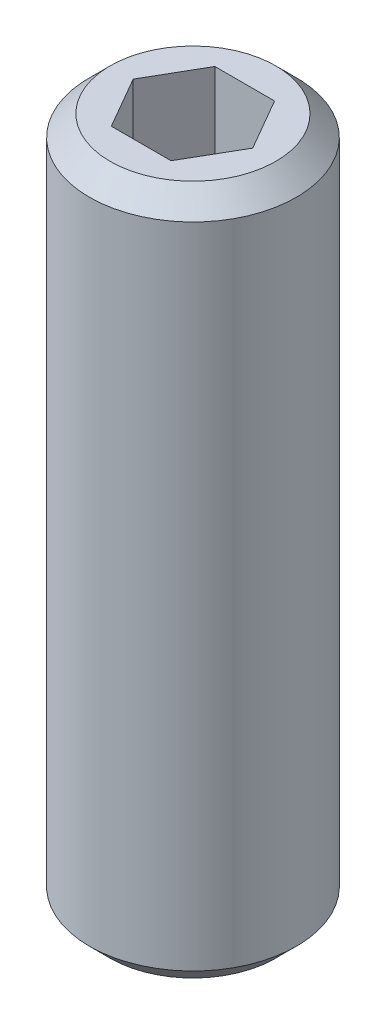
from build123d import *

# Parameters (mm, degrees)
ESQUISSE1_R             = 3
EXTRUSION1_DEPTH        = 20
ENL_V_MAT_EXTRU_1_DEPTH = 3
CHANFREIN1_SIZE         = 0.6


with BuildPart() as part:
    # Esquisse1 → Extrusion1 (new body)
    with BuildSketch(Plane(origin=(0, 0, 0), x_dir=(1, 0, 0), z_dir=(0, 1, 0))):
        with Locations(Location((0, 0, 0), (0, 0, 270))):
            Circle(ESQUISSE1_R)
    extrude(amount=-EXTRUSION1_DEPTH)

    # Esquisse2 → Enl_v. mat.-Extru.1 (cut)
    with BuildSketch(Plane(origin=(0, 0, 0), x_dir=(-1, 0, 0), z_dir=(0, 1, 0))):
        Polygon((0.866025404, -1.5), (1.732050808, 0), (0.866025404, 1.5), (-0.866025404, 1.5), (-1.732050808, 0), (-0.866025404, -1.5), align=None)
    extrude(amount=-ENL_V_MAT_EXTRU_1_DEPTH, mode=Mode.SUBTRACT)

    # Chanfrein1
    chanfrein1_edges = [part.edges().sort_by_distance(p)[0] for p in [
        (0, 0, -3),
        (0, -20, -3),
    ]]
    chamfer(chanfrein1_edges, length=CHANFREIN1_SIZE)


solid = part.part
